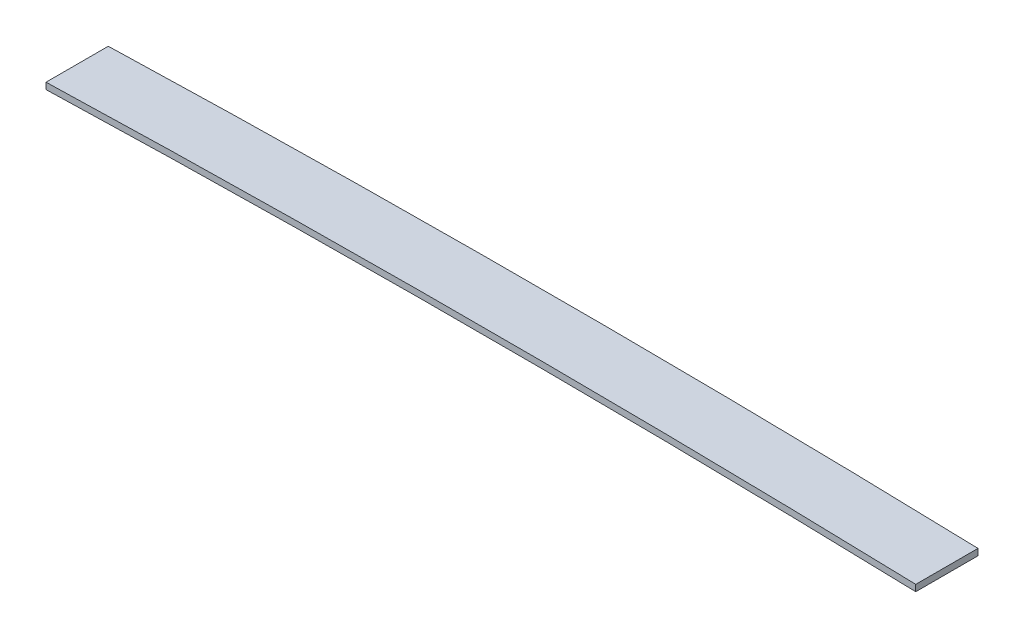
ISO-10303-21;
HEADER;
FILE_DESCRIPTION(('STEP AP214'),'2;1');
FILE_NAME('part.step','',(''),(''),'','','');
FILE_SCHEMA(('AUTOMOTIVE_DESIGN { 1 0 10303 214 1 1 1 1 }'));
ENDSEC;
DATA;
#1=APPLICATION_CONTEXT('core data for automotive mechanical design processes');
#2=APPLICATION_PROTOCOL_DEFINITION('international standard','automotive_design',2000,#1);
#3=PRODUCT_CONTEXT('',#1,'mechanical');
#4=PRODUCT('Part','Part','',(#3));
#5=PRODUCT_RELATED_PRODUCT_CATEGORY('part','',(#4));
#6=PRODUCT_DEFINITION_FORMATION('','',#4);
#7=PRODUCT_DEFINITION_CONTEXT('part definition',#1,'design');
#8=PRODUCT_DEFINITION('design','',#6,#7);
#9=PRODUCT_DEFINITION_SHAPE('','',#8);
#10=(LENGTH_UNIT() NAMED_UNIT(*) SI_UNIT(.MILLI.,.METRE.));
#11=(NAMED_UNIT(*) PLANE_ANGLE_UNIT() SI_UNIT($,.RADIAN.));
#12=(NAMED_UNIT(*) SI_UNIT($,.STERADIAN.) SOLID_ANGLE_UNIT());
#13=UNCERTAINTY_MEASURE_WITH_UNIT(LENGTH_MEASURE(1.E-05),#10,'distance_accuracy_value','');
#14=(GEOMETRIC_REPRESENTATION_CONTEXT(3) GLOBAL_UNCERTAINTY_ASSIGNED_CONTEXT((#13)) GLOBAL_UNIT_ASSIGNED_CONTEXT((#10,
#11,#12)) REPRESENTATION_CONTEXT('',''));
#15=CARTESIAN_POINT('',(0.,0.,0.));
#16=DIRECTION('',(0.,0.,1.));
#17=DIRECTION('',(1.,0.,0.));
#18=AXIS2_PLACEMENT_3D('',#15,#16,#17);
#19=CARTESIAN_POINT('',(0.,-14889.0576923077,31.5));
#20=DIRECTION('',(0.,0.,-1.));
#21=DIRECTION('',(-1.,0.,0.));
#22=AXIS2_PLACEMENT_3D('',#19,#20,#21);
#23=CYLINDRICAL_SURFACE('',#22,14895.5576923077);
#24=CARTESIAN_POINT('',(0.,-14889.0576923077,-31.5));
#25=DIRECTION('',(0.,0.,-1.));
#26=DIRECTION('',(-1.,0.,0.));
#27=AXIS2_PLACEMENT_3D('',#24,#25,#26);
#28=CIRCLE('',#27,14895.5576923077);
#29=CARTESIAN_POINT('',(-440.,0.,-31.5));
#30=VERTEX_POINT('',#29);
#31=CARTESIAN_POINT('',(440.,0.,-31.5));
#32=VERTEX_POINT('',#31);
#33=EDGE_CURVE('E98',#30,#32,#28,.T.);
#34=ORIENTED_EDGE('',*,*,#33,.T.);
#35=DIRECTION('',(0.,0.,-1.));
#36=VECTOR('',#35,1.);
#37=CARTESIAN_POINT('',(440.,0.,31.5));
#38=LINE('',#37,#36);
#39=CARTESIAN_POINT('',(440.,0.,31.5));
#40=VERTEX_POINT('',#39);
#41=EDGE_CURVE('E11',#40,#32,#38,.T.);
#42=ORIENTED_EDGE('',*,*,#41,.F.);
#43=CARTESIAN_POINT('',(0.,-14889.0576923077,31.5));
#44=DIRECTION('',(0.,0.,-1.));
#45=DIRECTION('',(-1.,0.,0.));
#46=AXIS2_PLACEMENT_3D('',#43,#44,#45);
#47=CIRCLE('',#46,14895.5576923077);
#48=CARTESIAN_POINT('',(-440.,0.,31.5));
#49=VERTEX_POINT('',#48);
#50=EDGE_CURVE('E86',#49,#40,#47,.T.);
#51=ORIENTED_EDGE('',*,*,#50,.F.);
#52=DIRECTION('',(0.,0.,-1.));
#53=VECTOR('',#52,1.);
#54=CARTESIAN_POINT('',(-440.,0.,31.5));
#55=LINE('',#54,#53);
#56=EDGE_CURVE('E94',#49,#30,#55,.T.);
#57=ORIENTED_EDGE('',*,*,#56,.T.);
#58=EDGE_LOOP('',(#34,#42,#51,#57));
#59=FACE_BOUND('',#58,.T.);
#60=ADVANCED_FACE('F35',(#59),#23,.F.);
#61=CARTESIAN_POINT('',(440.,6.5,31.5));
#62=DIRECTION('',(-1.,0.,0.));
#63=DIRECTION('',(0.,0.,1.));
#64=AXIS2_PLACEMENT_3D('',#61,#62,#63);
#65=PLANE('',#64);
#66=DIRECTION('',(0.,1.,0.));
#67=VECTOR('',#66,1.);
#68=CARTESIAN_POINT('',(440.,6.5,-31.5));
#69=LINE('',#68,#67);
#70=CARTESIAN_POINT('',(440.,6.49999999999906,-31.5));
#71=VERTEX_POINT('',#70);
#72=EDGE_CURVE('E90',#32,#71,#69,.T.);
#73=ORIENTED_EDGE('',*,*,#72,.T.);
#74=DIRECTION('',(0.,0.,-1.));
#75=VECTOR('',#74,1.);
#76=CARTESIAN_POINT('',(440.,6.49999999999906,31.5));
#77=LINE('',#76,#75);
#78=CARTESIAN_POINT('',(440.,6.49999999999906,31.5));
#79=VERTEX_POINT('',#78);
#80=EDGE_CURVE('E43',#79,#71,#77,.T.);
#81=ORIENTED_EDGE('',*,*,#80,.F.);
#82=DIRECTION('',(0.,1.,0.));
#83=VECTOR('',#82,1.);
#84=CARTESIAN_POINT('',(440.,6.5,31.5));
#85=LINE('',#84,#83);
#86=EDGE_CURVE('E81',#40,#79,#85,.T.);
#87=ORIENTED_EDGE('',*,*,#86,.F.);
#88=ORIENTED_EDGE('',*,*,#41,.T.);
#89=EDGE_LOOP('',(#73,#81,#87,#88));
#90=FACE_BOUND('',#89,.T.);
#91=ADVANCED_FACE('F89',(#90),#65,.F.);
#92=CARTESIAN_POINT('',(0.,-14882.5576923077,31.5));
#93=DIRECTION('',(0.,0.,-1.));
#94=DIRECTION('',(-1.,0.,0.));
#95=AXIS2_PLACEMENT_3D('',#92,#93,#94);
#96=CYLINDRICAL_SURFACE('',#95,14895.5576923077);
#97=CARTESIAN_POINT('',(0.,-14882.5576923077,-31.5));
#98=DIRECTION('',(0.,0.,1.));
#99=DIRECTION('',(-1.,0.,0.));
#100=AXIS2_PLACEMENT_3D('',#97,#98,#99);
#101=CIRCLE('',#100,14895.5576923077);
#102=CARTESIAN_POINT('',(-440.,6.5,-31.5));
#103=VERTEX_POINT('',#102);
#104=EDGE_CURVE('E68',#71,#103,#101,.T.);
#105=ORIENTED_EDGE('',*,*,#104,.T.);
#106=DIRECTION('',(0.,0.,-1.));
#107=VECTOR('',#106,1.);
#108=CARTESIAN_POINT('',(-440.,6.5,31.5));
#109=LINE('',#108,#107);
#110=CARTESIAN_POINT('',(-440.,6.5,31.5));
#111=VERTEX_POINT('',#110);
#112=EDGE_CURVE('E91',#111,#103,#109,.T.);
#113=ORIENTED_EDGE('',*,*,#112,.F.);
#114=CARTESIAN_POINT('',(0.,-14882.5576923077,31.5));
#115=DIRECTION('',(0.,0.,1.));
#116=DIRECTION('',(-1.,0.,0.));
#117=AXIS2_PLACEMENT_3D('',#114,#115,#116);
#118=CIRCLE('',#117,14895.5576923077);
#119=EDGE_CURVE('E84',#79,#111,#118,.T.);
#120=ORIENTED_EDGE('',*,*,#119,.F.);
#121=ORIENTED_EDGE('',*,*,#80,.T.);
#122=EDGE_LOOP('',(#105,#113,#120,#121));
#123=FACE_BOUND('',#122,.T.);
#124=ADVANCED_FACE('F92',(#123),#96,.T.);
#125=CARTESIAN_POINT('',(-440.,6.5,31.5));
#126=DIRECTION('',(1.,0.,0.));
#127=DIRECTION('',(0.,0.,-1.));
#128=AXIS2_PLACEMENT_3D('',#125,#126,#127);
#129=PLANE('',#128);
#130=DIRECTION('',(0.,-1.,0.));
#131=VECTOR('',#130,1.);
#132=CARTESIAN_POINT('',(-440.,6.5,-31.5));
#133=LINE('',#132,#131);
#134=EDGE_CURVE('E74',#103,#30,#133,.T.);
#135=ORIENTED_EDGE('',*,*,#134,.T.);
#136=ORIENTED_EDGE('',*,*,#56,.F.);
#137=DIRECTION('',(0.,-1.,0.));
#138=VECTOR('',#137,1.);
#139=CARTESIAN_POINT('',(-440.,6.5,31.5));
#140=LINE('',#139,#138);
#141=EDGE_CURVE('E51',#111,#49,#140,.T.);
#142=ORIENTED_EDGE('',*,*,#141,.F.);
#143=ORIENTED_EDGE('',*,*,#112,.T.);
#144=EDGE_LOOP('',(#135,#136,#142,#143));
#145=FACE_BOUND('',#144,.T.);
#146=ADVANCED_FACE('F105',(#145),#129,.F.);
#147=CARTESIAN_POINT('',(0.,-14889.0576923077,31.5));
#148=DIRECTION('',(0.,0.,-1.));
#149=DIRECTION('',(-1.,0.,0.));
#150=AXIS2_PLACEMENT_3D('',#147,#148,#149);
#151=PLANE('',#150);
#152=ORIENTED_EDGE('',*,*,#50,.T.);
#153=ORIENTED_EDGE('',*,*,#86,.T.);
#154=ORIENTED_EDGE('',*,*,#119,.T.);
#155=ORIENTED_EDGE('',*,*,#141,.T.);
#156=EDGE_LOOP('',(#152,#153,#154,#155));
#157=FACE_BOUND('',#156,.T.);
#158=ADVANCED_FACE('F82',(#157),#151,.F.);
#159=CARTESIAN_POINT('',(0.,-14889.0576923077,-31.5));
#160=DIRECTION('',(0.,0.,-1.));
#161=DIRECTION('',(-1.,0.,0.));
#162=AXIS2_PLACEMENT_3D('',#159,#160,#161);
#163=PLANE('',#162);
#164=ORIENTED_EDGE('',*,*,#33,.F.);
#165=ORIENTED_EDGE('',*,*,#134,.F.);
#166=ORIENTED_EDGE('',*,*,#104,.F.);
#167=ORIENTED_EDGE('',*,*,#72,.F.);
#168=EDGE_LOOP('',(#164,#165,#166,#167));
#169=FACE_BOUND('',#168,.T.);
#170=ADVANCED_FACE('F108',(#169),#163,.T.);
#171=CLOSED_SHELL('',(#60,#91,#124,#146,#158,#170));
#172=MANIFOLD_SOLID_BREP('B2',#171);
#173=ADVANCED_BREP_SHAPE_REPRESENTATION('',(#18,#172),#14);
#174=SHAPE_DEFINITION_REPRESENTATION(#9,#173);
ENDSEC;
END-ISO-10303-21;
